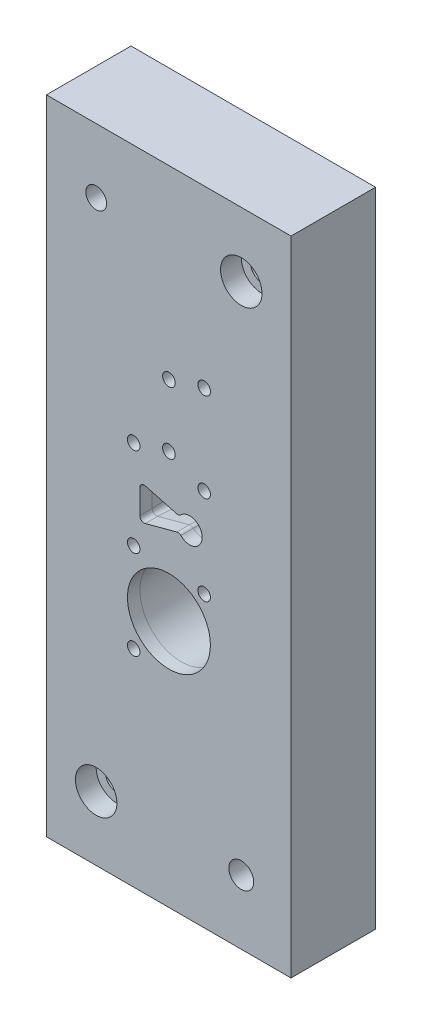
from build123d import *

# Parameters (mm, degrees)
ESQUISSE1_W                                     = 59
ESQUISSE1_H                                     = 155
ESQUISSE1_R                                     = 2.5035
ESQUISSE1_R_2                                   = 3.0035
EXTRUSION1_DEPTH                                = 20.4
CHAMBRAGE_POUR_VIS_T_TE_CYLINDRIQUE_D           = 5.5
CHAMBRAGE_POUR_VIS_T_TE_CYLINDRIQUE_CBORE_D     = 10
CHAMBRAGE_POUR_VIS_T_TE_CYLINDRIQUE_CBORE_DEPTH = 5
ESQUISSE4_R                                     = 10
ESQUISSE4_R_2                                   = 1.5285
ESQUISSE4_R_3                                   = 1.5035
ENL_V_MAT_EXTRU_1_DEPTH                         = 3
ESQUISSE5_R                                     = 10
ENL_V_MAT_EXTRU_2_DEPTH                         = 85.730513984
ENL_V_MAT_EXTRU_2_DRAFT                         = 3
ESQUISSE5_R_2                                   = 1.5285
ENL_V_MAT_EXTRU_2_PROFILE_2_DEPTH               = 85.730513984
ENL_V_MAT_EXTRU_2_PROFILE_2_DRAFT               = 3
ENL_V_MAT_EXTRU_2_PROFILE_3_DEPTH               = 85.730513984
ENL_V_MAT_EXTRU_2_PROFILE_3_DRAFT               = 3
ENL_V_MAT_EXTRU_2_PROFILE_4_DEPTH               = 85.730513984
ENL_V_MAT_EXTRU_2_PROFILE_4_DRAFT               = 3
ENL_V_MAT_EXTRU_2_PROFILE_5_DEPTH               = 85.730513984
ENL_V_MAT_EXTRU_2_PROFILE_5_DRAFT               = 3
ENL_V_MAT_EXTRU_2_PROFILE_6_DEPTH               = 85.730513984
ENL_V_MAT_EXTRU_2_PROFILE_6_DRAFT               = 3
ESQUISSE6_R                                     = 1.5035
ENL_V_MAT_EXTRU_3_DEPTH                         = 85.730513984


with BuildPart() as part:
    # Esquisse1 → Extrusion1 (new body)
    with BuildSketch(Plane.XY):
        Rectangle(ESQUISSE1_W, ESQUISSE1_H)
        with Locations((-17.5, 62)):
            Circle(ESQUISSE1_R, mode=Mode.SUBTRACT)
        with Locations((17.5, -62)):
            Circle(ESQUISSE1_R_2, mode=Mode.SUBTRACT)
    extrude(amount=EXTRUSION1_DEPTH)

    # Chambrage pour vis _ t_te cylindrique (through all)
    with Locations(Plane.XY.offset(20.4)):
        with Locations((17.5, 62), (-17.5, -62)):
            CounterBoreHole(CHAMBRAGE_POUR_VIS_T_TE_CYLINDRIQUE_D / 2, CHAMBRAGE_POUR_VIS_T_TE_CYLINDRIQUE_CBORE_D / 2, CHAMBRAGE_POUR_VIS_T_TE_CYLINDRIQUE_CBORE_DEPTH)

    # Esquisse4 → Enl_v. mat.-Extru.1 (cut)
    with BuildSketch(Plane.XY.offset(20.4)):
        with Locations((0.05, -17.7)):
            Circle(ESQUISSE4_R)
        with Locations((8.55, 35.267948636)):
            Circle(ESQUISSE4_R_2)
        with Locations((0.05, 32.8)):
            Circle(ESQUISSE4_R_2)
        with Locations((0.05, 17.8)):
            Circle(ESQUISSE4_R_2)
        with Locations((-8.45, 15.332051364)):
            Circle(ESQUISSE4_R_2)
        with Locations((8.55, 13.767948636)):
            Circle(ESQUISSE4_R_3)
        with Locations((-8.45, -6.167948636)):
            Circle(ESQUISSE4_R_3)
        with Locations((8.55, -7.732051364)):
            Circle(ESQUISSE4_R_3)
        with Locations((-8.45, -27.667948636)):
            Circle(ESQUISSE4_R_3)
        with BuildLine():
            Line((1.970518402, 5.691479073), (-5.683416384, 7.742344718))
            ThreePointArc((-5.683416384, 7.742344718), (-6.577024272, 7.564595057), (-6.98, 6.747441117))
            Line((-6.98, 6.747441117), (-6.98, 0.852558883))
            ThreePointArc((-6.98, 0.852558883), (-6.577024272, 0.035404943), (-5.683416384, -0.142344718))
            Line((-5.683416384, -0.142344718), (1.970518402, 1.908520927))
            ThreePointArc((1.970518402, 1.908520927), (2.472627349, 1.908520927), (2.907466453, 1.657466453))
            ThreePointArc((2.907466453, 1.657466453), (8.08, 3.8), (2.907466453, 5.942533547))
            ThreePointArc((2.907466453, 5.942533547), (2.472627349, 5.691479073), (1.970518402, 5.691479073))
        make_face()
    extrude(amount=-ENL_V_MAT_EXTRU_1_DEPTH, mode=Mode.SUBTRACT)


with BuildPart() as enl_v_mat_extru_2_tool:
    # Esquisse5 → Enl_v. mat.-Extru.2 (with draft: the straight prism first)
    with BuildSketch(Plane.XY.offset(17.4)):
        with Locations((0.05, -17.7)):
            Circle(ESQUISSE5_R)
    extrude(amount=-ENL_V_MAT_EXTRU_2_DEPTH)
    # Enl_v. mat.-Extru.2: the draft: its side faces are tilted about the plane it starts from
    enl_v_mat_extru_2_sides = [enl_v_mat_extru_2_tool.faces().sort_by_distance(p)[0] for p in [
        (-9.95, -17.7, -25.465256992),
    ]]
    draft(enl_v_mat_extru_2_sides, Plane.XY.offset(17.4), ENL_V_MAT_EXTRU_2_DRAFT)


with BuildPart() as part_1:
    add(part.part)

    # Enl_v. mat.-Extru.2: cut by enl_v_mat_extru_2_tool
    add(enl_v_mat_extru_2_tool.part, mode=Mode.SUBTRACT)


with BuildPart() as enl_v_mat_extru_2_profile_2_tool:
    # Esquisse5 → Enl_v. mat.-Extru.2 profile 2 (with draft: the straight prism first)
    with BuildSketch(Plane.XY.offset(17.4)):
        with Locations((0.05, 17.8)):
            Circle(ESQUISSE5_R_2)
    extrude(amount=-ENL_V_MAT_EXTRU_2_PROFILE_2_DEPTH)
    # Enl_v. mat.-Extru.2 profile 2: the draft: its side faces are tilted about the plane it starts from
    enl_v_mat_extru_2_profile_2_sides = [enl_v_mat_extru_2_profile_2_tool.faces().sort_by_distance(p)[0] for p in [
        (-1.4785, 17.8, -25.465256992),
    ]]
    draft(enl_v_mat_extru_2_profile_2_sides, Plane.XY.offset(17.4), ENL_V_MAT_EXTRU_2_PROFILE_2_DRAFT)


with BuildPart() as part_2:
    add(part_1.part)

    # Enl_v. mat.-Extru.2 profile 2: cut by enl_v_mat_extru_2_profile_2_tool
    add(enl_v_mat_extru_2_profile_2_tool.part, mode=Mode.SUBTRACT)


with BuildPart() as enl_v_mat_extru_2_profile_3_tool:
    # Esquisse5 → Enl_v. mat.-Extru.2 profile 3 (with draft: the straight prism first)
    with BuildSketch(Plane.XY.offset(17.4)):
        with Locations((-8.45, 15.332051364)):
            Circle(ESQUISSE5_R_2)
    extrude(amount=-ENL_V_MAT_EXTRU_2_PROFILE_3_DEPTH)
    # Enl_v. mat.-Extru.2 profile 3: the draft: its side faces are tilted about the plane it starts from
    enl_v_mat_extru_2_profile_3_sides = [enl_v_mat_extru_2_profile_3_tool.faces().sort_by_distance(p)[0] for p in [
        (-9.9785, 15.332051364, -25.465256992),
    ]]
    draft(enl_v_mat_extru_2_profile_3_sides, Plane.XY.offset(17.4), ENL_V_MAT_EXTRU_2_PROFILE_3_DRAFT)


with BuildPart() as part_3:
    add(part_2.part)

    # Enl_v. mat.-Extru.2 profile 3: cut by enl_v_mat_extru_2_profile_3_tool
    add(enl_v_mat_extru_2_profile_3_tool.part, mode=Mode.SUBTRACT)


with BuildPart() as enl_v_mat_extru_2_profile_4_tool:
    # Esquisse5 → Enl_v. mat.-Extru.2 profile 4 (with draft: the straight prism first)
    with BuildSketch(Plane.XY.offset(17.4)):
        with Locations((0.05, 32.8)):
            Circle(ESQUISSE5_R_2)
    extrude(amount=-ENL_V_MAT_EXTRU_2_PROFILE_4_DEPTH)
    # Enl_v. mat.-Extru.2 profile 4: the draft: its side faces are tilted about the plane it starts from
    enl_v_mat_extru_2_profile_4_sides = [enl_v_mat_extru_2_profile_4_tool.faces().sort_by_distance(p)[0] for p in [
        (-1.4785, 32.8, -25.465256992),
    ]]
    draft(enl_v_mat_extru_2_profile_4_sides, Plane.XY.offset(17.4), ENL_V_MAT_EXTRU_2_PROFILE_4_DRAFT)


with BuildPart() as part_4:
    add(part_3.part)

    # Enl_v. mat.-Extru.2 profile 4: cut by enl_v_mat_extru_2_profile_4_tool
    add(enl_v_mat_extru_2_profile_4_tool.part, mode=Mode.SUBTRACT)


with BuildPart() as enl_v_mat_extru_2_profile_5_tool:
    # Esquisse5 → Enl_v. mat.-Extru.2 profile 5 (with draft: the straight prism first)
    with BuildSketch(Plane.XY.offset(17.4)):
        with Locations((8.55, 35.267948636)):
            Circle(ESQUISSE5_R_2)
    extrude(amount=-ENL_V_MAT_EXTRU_2_PROFILE_5_DEPTH)
    # Enl_v. mat.-Extru.2 profile 5: the draft: its side faces are tilted about the plane it starts from
    enl_v_mat_extru_2_profile_5_sides = [enl_v_mat_extru_2_profile_5_tool.faces().sort_by_distance(p)[0] for p in [
        (7.0215, 35.267948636, -25.465256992),
    ]]
    draft(enl_v_mat_extru_2_profile_5_sides, Plane.XY.offset(17.4), ENL_V_MAT_EXTRU_2_PROFILE_5_DRAFT)


with BuildPart() as part_5:
    add(part_4.part)

    # Enl_v. mat.-Extru.2 profile 5: cut by enl_v_mat_extru_2_profile_5_tool
    add(enl_v_mat_extru_2_profile_5_tool.part, mode=Mode.SUBTRACT)


with BuildPart() as enl_v_mat_extru_2_profile_6_tool:
    # Esquisse5 → Enl_v. mat.-Extru.2 profile 6 (with draft: the straight prism first)
    with BuildSketch(Plane.XY.offset(17.4)):
        with BuildLine():
            Line((1.970518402, 5.691479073), (-5.683416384, 7.742344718))
            ThreePointArc((-5.683416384, 7.742344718), (-6.577024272, 7.564595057), (-6.98, 6.747441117))
            Line((-6.98, 6.747441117), (-6.98, 0.852558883))
            ThreePointArc((-6.98, 0.852558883), (-6.577024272, 0.035404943), (-5.683416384, -0.142344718))
            Line((-5.683416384, -0.142344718), (1.970518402, 1.908520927))
            ThreePointArc((1.970518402, 1.908520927), (2.472627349, 1.908520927), (2.907466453, 1.657466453))
            ThreePointArc((2.907466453, 1.657466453), (8.08, 3.8), (2.907466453, 5.942533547))
            ThreePointArc((2.907466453, 5.942533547), (2.472627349, 5.691479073), (1.970518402, 5.691479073))
        make_face()
    extrude(amount=-ENL_V_MAT_EXTRU_2_PROFILE_6_DEPTH)
    # Enl_v. mat.-Extru.2 profile 6: the draft: its side faces are tilted about the plane it starts from
    enl_v_mat_extru_2_profile_6_sides = [enl_v_mat_extru_2_profile_6_tool.faces().sort_by_distance(p)[0] for p in [
        (2.472627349, 5.691479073, -25.465256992),
        (-1.856448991, 6.716911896, -25.465256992),
        (-6.577024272, 7.564595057, -25.465256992),
        (-6.98, 3.8, -25.465256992),
        (-6.577024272, 0.035404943, -25.465256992),
        (-1.856448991, 0.883088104, -25.465256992),
        (2.472627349, 1.908520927, -25.465256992),
        (8.08, 3.8, -25.465256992),
    ]]
    draft(enl_v_mat_extru_2_profile_6_sides, Plane.XY.offset(17.4), ENL_V_MAT_EXTRU_2_PROFILE_6_DRAFT)


with BuildPart() as part_6:
    add(part_5.part)

    # Enl_v. mat.-Extru.2 profile 6: cut by enl_v_mat_extru_2_profile_6_tool
    add(enl_v_mat_extru_2_profile_6_tool.part, mode=Mode.SUBTRACT)

    # Esquisse6 → Enl_v. mat.-Extru.3 (cut, through all)
    with BuildSketch(Plane.XY.offset(17.4)):
        with Locations((8.55, 13.767948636)):
            Circle(ESQUISSE6_R)
        with Locations((-8.45, -6.167948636)):
            Circle(ESQUISSE6_R)
        with Locations((8.55, -7.732051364)):
            Circle(ESQUISSE6_R)
        with Locations((-8.45, -27.667948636)):
            Circle(ESQUISSE6_R)
    extrude(amount=-ENL_V_MAT_EXTRU_3_DEPTH, mode=Mode.SUBTRACT)


solid = part_6.part
